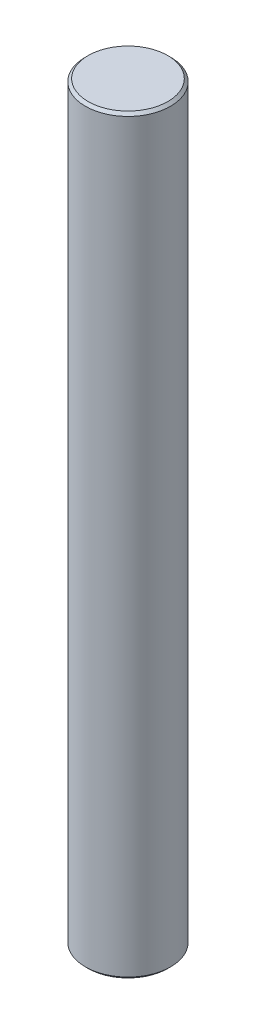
ISO-10303-21;
HEADER;
FILE_DESCRIPTION(('STEP AP214'),'2;1');
FILE_NAME('part.step','',(''),(''),'','','');
FILE_SCHEMA(('AUTOMOTIVE_DESIGN { 1 0 10303 214 1 1 1 1 }'));
ENDSEC;
DATA;
#1=APPLICATION_CONTEXT('core data for automotive mechanical design processes');
#2=APPLICATION_PROTOCOL_DEFINITION('international standard','automotive_design',2000,#1);
#3=PRODUCT_CONTEXT('',#1,'mechanical');
#4=PRODUCT('Part','Part','',(#3));
#5=PRODUCT_RELATED_PRODUCT_CATEGORY('part','',(#4));
#6=PRODUCT_DEFINITION_FORMATION('','',#4);
#7=PRODUCT_DEFINITION_CONTEXT('part definition',#1,'design');
#8=PRODUCT_DEFINITION('design','',#6,#7);
#9=PRODUCT_DEFINITION_SHAPE('','',#8);
#10=(LENGTH_UNIT() NAMED_UNIT(*) SI_UNIT(.MILLI.,.METRE.));
#11=(NAMED_UNIT(*) PLANE_ANGLE_UNIT() SI_UNIT($,.RADIAN.));
#12=(NAMED_UNIT(*) SI_UNIT($,.STERADIAN.) SOLID_ANGLE_UNIT());
#13=UNCERTAINTY_MEASURE_WITH_UNIT(LENGTH_MEASURE(1.E-05),#10,'distance_accuracy_value','');
#14=(GEOMETRIC_REPRESENTATION_CONTEXT(3) GLOBAL_UNCERTAINTY_ASSIGNED_CONTEXT((#13)) GLOBAL_UNIT_ASSIGNED_CONTEXT((#10,
#11,#12)) REPRESENTATION_CONTEXT('',''));
#15=CARTESIAN_POINT('',(0.,0.,0.));
#16=DIRECTION('',(0.,0.,1.));
#17=DIRECTION('',(1.,0.,0.));
#18=AXIS2_PLACEMENT_3D('',#15,#16,#17);
#19=CARTESIAN_POINT('',(0.,34.925,0.));
#20=DIRECTION('',(0.,-1.,0.));
#21=DIRECTION('',(0.,0.,-1.));
#22=AXIS2_PLACEMENT_3D('',#19,#20,#21);
#23=CYLINDRICAL_SURFACE('',#22,3.9624);
#24=CARTESIAN_POINT('',(0.,-34.671,0.));
#25=DIRECTION('',(0.,1.,0.));
#26=DIRECTION('',(0.,0.,1.));
#27=AXIS2_PLACEMENT_3D('',#24,#25,#26);
#28=CIRCLE('',#27,3.9624);
#29=CARTESIAN_POINT('',(0.,-34.671,3.9624));
#30=VERTEX_POINT('',#29);
#31=EDGE_CURVE('E42',#30,#30,#28,.T.);
#32=ORIENTED_EDGE('',*,*,#31,.T.);
#33=EDGE_LOOP('',(#32));
#34=FACE_BOUND('',#33,.T.);
#35=CARTESIAN_POINT('',(0.,34.671,0.));
#36=DIRECTION('',(0.,1.,0.));
#37=DIRECTION('',(0.,0.,1.));
#38=AXIS2_PLACEMENT_3D('',#35,#36,#37);
#39=CIRCLE('',#38,3.9624);
#40=CARTESIAN_POINT('',(0.,34.671,3.9624));
#41=VERTEX_POINT('',#40);
#42=EDGE_CURVE('E46',#41,#41,#39,.F.);
#43=ORIENTED_EDGE('',*,*,#42,.T.);
#44=EDGE_LOOP('',(#43));
#45=FACE_BOUND('',#44,.T.);
#46=ADVANCED_FACE('F31',(#34,#45),#23,.T.);
#47=CARTESIAN_POINT('',(0.,34.925,0.));
#48=DIRECTION('',(0.,1.,0.));
#49=DIRECTION('',(0.,0.,1.));
#50=AXIS2_PLACEMENT_3D('',#47,#48,#49);
#51=PLANE('',#50);
#52=CARTESIAN_POINT('',(0.,34.925,0.));
#53=DIRECTION('',(0.,1.,0.));
#54=DIRECTION('',(0.,0.,1.));
#55=AXIS2_PLACEMENT_3D('',#52,#53,#54);
#56=CIRCLE('',#55,3.7084);
#57=CARTESIAN_POINT('',(0.,34.925,3.7084));
#58=VERTEX_POINT('',#57);
#59=EDGE_CURVE('E10',#58,#58,#56,.T.);
#60=ORIENTED_EDGE('',*,*,#59,.T.);
#61=EDGE_LOOP('',(#60));
#62=FACE_BOUND('',#61,.T.);
#63=ADVANCED_FACE('F62',(#62),#51,.T.);
#64=CARTESIAN_POINT('',(0.,-34.925,0.));
#65=DIRECTION('',(0.,1.,0.));
#66=DIRECTION('',(0.,0.,1.));
#67=AXIS2_PLACEMENT_3D('',#64,#65,#66);
#68=PLANE('',#67);
#69=CARTESIAN_POINT('',(0.,-34.925,0.));
#70=DIRECTION('',(0.,1.,0.));
#71=DIRECTION('',(0.,0.,1.));
#72=AXIS2_PLACEMENT_3D('',#69,#70,#71);
#73=CIRCLE('',#72,3.7084);
#74=CARTESIAN_POINT('',(0.,-34.925,3.7084));
#75=VERTEX_POINT('',#74);
#76=EDGE_CURVE('E38',#75,#75,#73,.F.);
#77=ORIENTED_EDGE('',*,*,#76,.T.);
#78=EDGE_LOOP('',(#77));
#79=FACE_BOUND('',#78,.T.);
#80=ADVANCED_FACE('F59',(#79),#68,.F.);
#81=CARTESIAN_POINT('',(0.,-34.671,0.));
#82=DIRECTION('',(0.,1.,0.));
#83=DIRECTION('',(0.,0.,1.));
#84=AXIS2_PLACEMENT_3D('',#81,#82,#83);
#85=CONICAL_SURFACE('',#84,3.9624,0.785398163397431);
#86=ORIENTED_EDGE('',*,*,#76,.F.);
#87=EDGE_LOOP('',(#86));
#88=FACE_BOUND('',#87,.T.);
#89=ORIENTED_EDGE('',*,*,#31,.F.);
#90=EDGE_LOOP('',(#89));
#91=FACE_BOUND('',#90,.T.);
#92=ADVANCED_FACE('F55',(#88,#91),#85,.T.);
#93=CARTESIAN_POINT('',(0.,34.925,0.));
#94=DIRECTION('',(0.,-1.,0.));
#95=DIRECTION('',(0.,0.,-1.));
#96=AXIS2_PLACEMENT_3D('',#93,#94,#95);
#97=CONICAL_SURFACE('',#96,3.7084,0.785398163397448);
#98=ORIENTED_EDGE('',*,*,#42,.F.);
#99=EDGE_LOOP('',(#98));
#100=FACE_BOUND('',#99,.T.);
#101=ORIENTED_EDGE('',*,*,#59,.F.);
#102=EDGE_LOOP('',(#101));
#103=FACE_BOUND('',#102,.T.);
#104=ADVANCED_FACE('F33',(#100,#103),#97,.T.);
#105=CLOSED_SHELL('',(#46,#63,#80,#92,#104));
#106=MANIFOLD_SOLID_BREP('B2',#105);
#107=ADVANCED_BREP_SHAPE_REPRESENTATION('',(#18,#106),#14);
#108=SHAPE_DEFINITION_REPRESENTATION(#9,#107);
ENDSEC;
END-ISO-10303-21;
